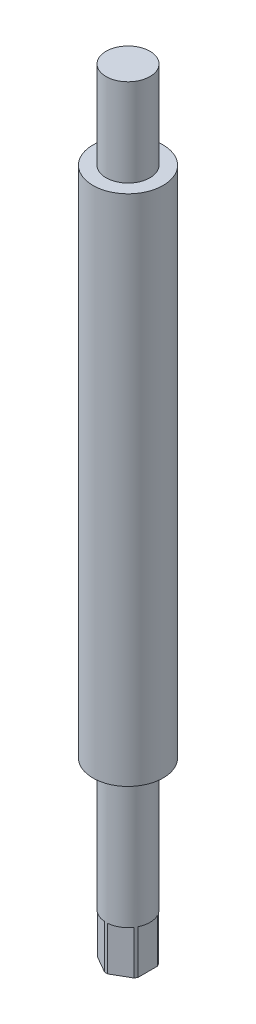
ISO-10303-21;
HEADER;
FILE_DESCRIPTION(('STEP AP214'),'2;1');
FILE_NAME('part.step','',(''),(''),'','','');
FILE_SCHEMA(('AUTOMOTIVE_DESIGN { 1 0 10303 214 1 1 1 1 }'));
ENDSEC;
DATA;
#1=APPLICATION_CONTEXT('core data for automotive mechanical design processes');
#2=APPLICATION_PROTOCOL_DEFINITION('international standard','automotive_design',2000,#1);
#3=PRODUCT_CONTEXT('',#1,'mechanical');
#4=PRODUCT('Part','Part','',(#3));
#5=PRODUCT_RELATED_PRODUCT_CATEGORY('part','',(#4));
#6=PRODUCT_DEFINITION_FORMATION('','',#4);
#7=PRODUCT_DEFINITION_CONTEXT('part definition',#1,'design');
#8=PRODUCT_DEFINITION('design','',#6,#7);
#9=PRODUCT_DEFINITION_SHAPE('','',#8);
#10=(LENGTH_UNIT() NAMED_UNIT(*) SI_UNIT(.MILLI.,.METRE.));
#11=(NAMED_UNIT(*) PLANE_ANGLE_UNIT() SI_UNIT($,.RADIAN.));
#12=(NAMED_UNIT(*) SI_UNIT($,.STERADIAN.) SOLID_ANGLE_UNIT());
#13=UNCERTAINTY_MEASURE_WITH_UNIT(LENGTH_MEASURE(1.E-05),#10,'distance_accuracy_value','');
#14=(GEOMETRIC_REPRESENTATION_CONTEXT(3) GLOBAL_UNCERTAINTY_ASSIGNED_CONTEXT((#13)) GLOBAL_UNIT_ASSIGNED_CONTEXT((#10,
#11,#12)) REPRESENTATION_CONTEXT('',''));
#15=CARTESIAN_POINT('',(0.,0.,0.));
#16=DIRECTION('',(0.,0.,1.));
#17=DIRECTION('',(1.,0.,0.));
#18=AXIS2_PLACEMENT_3D('',#15,#16,#17);
#19=CARTESIAN_POINT('',(0.,0.,0.));
#20=DIRECTION('',(0.,1.,0.));
#21=DIRECTION('',(0.,0.,1.00000000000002));
#22=AXIS2_PLACEMENT_3D('',#19,#20,#21);
#23=PLANE('',#22);
#24=DIRECTION('',(-0.866025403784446,0.,0.500000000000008));
#25=VECTOR('',#24,1.);
#26=CARTESIAN_POINT('',(4.49999999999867,-1.06858966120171E-12,2.59807621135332));
#27=LINE('',#26,#25);
#28=CARTESIAN_POINT('',(4.13745860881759,0.,2.80738958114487));
#29=VERTEX_POINT('',#28);
#30=CARTESIAN_POINT('',(0.362541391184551,-5.41233724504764E-13,4.98683905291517));
#31=VERTEX_POINT('',#30);
#32=EDGE_CURVE('E140',#29,#31,#27,.T.);
#33=ORIENTED_EDGE('',*,*,#32,.T.);
#34=CARTESIAN_POINT('',(0.,0.,0.));
#35=DIRECTION('',(0.,-1.,0.));
#36=DIRECTION('',(0.,0.,-1.00000000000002));
#37=AXIS2_PLACEMENT_3D('',#34,#35,#36);
#38=CIRCLE('',#37,4.99999999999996);
#39=CARTESIAN_POINT('',(-0.362541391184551,-6.52256026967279E-13,4.98683905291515));
#40=VERTEX_POINT('',#39);
#41=EDGE_CURVE('E139',#31,#40,#38,.T.);
#42=ORIENTED_EDGE('',*,*,#41,.T.);
#43=DIRECTION('',(-0.866025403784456,0.,-0.500000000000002));
#44=VECTOR('',#43,1.);
#45=CARTESIAN_POINT('',(0.,-1.06858966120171E-12,5.1961524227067));
#46=LINE('',#45,#44);
#47=CARTESIAN_POINT('',(-4.13745860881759,0.,2.8073895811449));
#48=VERTEX_POINT('',#47);
#49=EDGE_CURVE('E123',#40,#48,#46,.T.);
#50=ORIENTED_EDGE('',*,*,#49,.T.);
#51=CARTESIAN_POINT('',(-4.5,0.,2.17944947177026));
#52=VERTEX_POINT('',#51);
#53=EDGE_CURVE('E137',#48,#52,#38,.T.);
#54=ORIENTED_EDGE('',*,*,#53,.T.);
#55=DIRECTION('',(0.,0.,-1.00000000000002));
#56=VECTOR('',#55,1.);
#57=CARTESIAN_POINT('',(-4.49999999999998,0.,2.59807621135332));
#58=LINE('',#57,#56);
#59=CARTESIAN_POINT('',(-4.5,0.,-2.17944947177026));
#60=VERTEX_POINT('',#59);
#61=EDGE_CURVE('E55',#52,#60,#58,.T.);
#62=ORIENTED_EDGE('',*,*,#61,.T.);
#63=CARTESIAN_POINT('',(-4.13745860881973,2.22044604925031E-13,-2.80738958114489));
#64=VERTEX_POINT('',#63);
#65=EDGE_CURVE('E145',#60,#64,#38,.T.);
#66=ORIENTED_EDGE('',*,*,#65,.T.);
#67=DIRECTION('',(0.866025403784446,0.,-0.500000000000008));
#68=VECTOR('',#67,1.);
#69=CARTESIAN_POINT('',(-4.50000000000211,0.,-2.59807621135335));
#70=LINE('',#69,#68);
#71=CARTESIAN_POINT('',(-0.362541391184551,-2.22044604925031E-13,-4.98683905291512));
#72=VERTEX_POINT('',#71);
#73=EDGE_CURVE('E47',#64,#72,#70,.T.);
#74=ORIENTED_EDGE('',*,*,#73,.T.);
#75=CARTESIAN_POINT('',(0.362541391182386,0.,-4.98683905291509));
#76=VERTEX_POINT('',#75);
#77=EDGE_CURVE('E149',#72,#76,#38,.T.);
#78=ORIENTED_EDGE('',*,*,#77,.T.);
#79=DIRECTION('',(0.866025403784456,0.,0.500000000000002));
#80=VECTOR('',#79,1.);
#81=CARTESIAN_POINT('',(-2.13717932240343E-12,0.,-5.19615242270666));
#82=LINE('',#81,#80);
#83=CARTESIAN_POINT('',(4.13745860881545,-2.35922392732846E-13,-2.8073895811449));
#84=VERTEX_POINT('',#83);
#85=EDGE_CURVE('E208',#76,#84,#82,.T.);
#86=ORIENTED_EDGE('',*,*,#85,.T.);
#87=CARTESIAN_POINT('',(4.49999999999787,-8.74300631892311E-13,-2.17944947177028));
#88=VERTEX_POINT('',#87);
#89=EDGE_CURVE('E154',#84,#88,#38,.T.);
#90=ORIENTED_EDGE('',*,*,#89,.T.);
#91=DIRECTION('',(0.,0.,1.00000000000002));
#92=VECTOR('',#91,1.);
#93=CARTESIAN_POINT('',(4.49999999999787,-4.02455846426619E-13,-2.59807621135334));
#94=LINE('',#93,#92);
#95=CARTESIAN_POINT('',(4.49999999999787,-4.9960036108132E-13,2.17944947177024));
#96=VERTEX_POINT('',#95);
#97=EDGE_CURVE('E214',#88,#96,#94,.T.);
#98=ORIENTED_EDGE('',*,*,#97,.T.);
#99=EDGE_CURVE('E147',#96,#29,#38,.T.);
#100=ORIENTED_EDGE('',*,*,#99,.T.);
#101=EDGE_LOOP('',(#33,#42,#50,#54,#62,#66,#74,#78,#86,#90,#98,#100));
#102=FACE_BOUND('',#101,.T.);
#103=ADVANCED_FACE('F33',(#102),#23,.F.);
#104=CARTESIAN_POINT('',(0.,-17.5398947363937,0.));
#105=DIRECTION('',(0.,-1.,0.));
#106=DIRECTION('',(0.,0.,-1.00000000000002));
#107=AXIS2_PLACEMENT_3D('',#104,#105,#106);
#108=CYLINDRICAL_SURFACE('',#107,4.99999999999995);
#109=CARTESIAN_POINT('',(0.,40.,0.));
#110=DIRECTION('',(0.,-1.,0.));
#111=DIRECTION('',(0.,0.,-1.00000000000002));
#112=AXIS2_PLACEMENT_3D('',#109,#110,#111);
#113=CIRCLE('',#112,4.99999999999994);
#114=CARTESIAN_POINT('',(0.,40.,-5.00000000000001));
#115=VERTEX_POINT('',#114);
#116=EDGE_CURVE('E153',#115,#115,#113,.T.);
#117=ORIENTED_EDGE('',*,*,#116,.T.);
#118=EDGE_LOOP('',(#117));
#119=FACE_BOUND('',#118,.T.);
#120=DIRECTION('',(0.,-1.,0.));
#121=VECTOR('',#120,1.);
#122=CARTESIAN_POINT('',(0.362541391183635,-17.5398947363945,4.98683905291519));
#123=LINE('',#122,#121);
#124=CARTESIAN_POINT('',(0.362541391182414,9.99999999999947,4.98683905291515));
#125=VERTEX_POINT('',#124);
#126=EDGE_CURVE('E12',#125,#31,#123,.T.);
#127=ORIENTED_EDGE('',*,*,#126,.F.);
#128=CARTESIAN_POINT('',(-2.13717932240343E-12,9.99999999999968,0.));
#129=DIRECTION('',(0.,-1.,0.));
#130=DIRECTION('',(0.,0.,-1.00000000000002));
#131=AXIS2_PLACEMENT_3D('',#128,#129,#130);
#132=CIRCLE('',#131,4.99999999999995);
#133=CARTESIAN_POINT('',(4.13745860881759,9.99999999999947,2.80738958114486));
#134=VERTEX_POINT('',#133);
#135=EDGE_CURVE('E40',#134,#125,#132,.T.);
#136=ORIENTED_EDGE('',*,*,#135,.F.);
#137=DIRECTION('',(0.,-1.,0.));
#138=VECTOR('',#137,1.);
#139=CARTESIAN_POINT('',(4.13745860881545,-17.5398947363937,2.80738958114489));
#140=LINE('',#139,#138);
#141=EDGE_CURVE('E177',#29,#134,#140,.F.);
#142=ORIENTED_EDGE('',*,*,#141,.F.);
#143=ORIENTED_EDGE('',*,*,#99,.F.);
#144=DIRECTION('',(0.,-1.,0.));
#145=VECTOR('',#144,1.);
#146=CARTESIAN_POINT('',(4.49999999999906,-17.5398947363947,2.17944947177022));
#147=LINE('',#146,#145);
#148=CARTESIAN_POINT('',(4.49999999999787,9.9999999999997,2.17944947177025));
#149=VERTEX_POINT('',#148);
#150=EDGE_CURVE('E176',#149,#96,#147,.T.);
#151=ORIENTED_EDGE('',*,*,#150,.F.);
#152=CARTESIAN_POINT('',(4.49999999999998,9.99999999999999,-2.17944947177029));
#153=VERTEX_POINT('',#152);
#154=EDGE_CURVE('E175',#153,#149,#132,.T.);
#155=ORIENTED_EDGE('',*,*,#154,.F.);
#156=DIRECTION('',(0.,-1.,0.));
#157=VECTOR('',#156,1.);
#158=CARTESIAN_POINT('',(4.49999999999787,-17.5398947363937,-2.17944947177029));
#159=LINE('',#158,#157);
#160=EDGE_CURVE('E173',#88,#153,#159,.F.);
#161=ORIENTED_EDGE('',*,*,#160,.F.);
#162=ORIENTED_EDGE('',*,*,#89,.F.);
#163=DIRECTION('',(0.,-1.,0.));
#164=VECTOR('',#163,1.);
#165=CARTESIAN_POINT('',(4.13745860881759,-17.5398947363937,-2.80738958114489));
#166=LINE('',#165,#164);
#167=CARTESIAN_POINT('',(4.13745860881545,9.99999999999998,-2.8073895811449));
#168=VERTEX_POINT('',#167);
#169=EDGE_CURVE('E171',#168,#84,#166,.T.);
#170=ORIENTED_EDGE('',*,*,#169,.F.);
#171=CARTESIAN_POINT('',(0.362541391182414,9.99999999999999,-4.98683905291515));
#172=VERTEX_POINT('',#171);
#173=EDGE_CURVE('E170',#172,#168,#132,.T.);
#174=ORIENTED_EDGE('',*,*,#173,.F.);
#175=DIRECTION('',(0.,-1.,0.));
#176=VECTOR('',#175,1.);
#177=CARTESIAN_POINT('',(0.362541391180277,-17.5398947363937,-4.98683905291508));
#178=LINE('',#177,#176);
#179=EDGE_CURVE('E168',#76,#172,#178,.F.);
#180=ORIENTED_EDGE('',*,*,#179,.F.);
#181=ORIENTED_EDGE('',*,*,#77,.F.);
#182=DIRECTION('',(0.,-1.,0.));
#183=VECTOR('',#182,1.);
#184=CARTESIAN_POINT('',(-0.362541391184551,-17.5398947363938,-4.98683905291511));
#185=LINE('',#184,#183);
#186=CARTESIAN_POINT('',(-0.362541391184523,9.99999999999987,-4.98683905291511));
#187=VERTEX_POINT('',#186);
#188=EDGE_CURVE('E166',#187,#72,#185,.T.);
#189=ORIENTED_EDGE('',*,*,#188,.F.);
#190=CARTESIAN_POINT('',(-4.13745860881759,10.,-2.80738958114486));
#191=VERTEX_POINT('',#190);
#192=EDGE_CURVE('E165',#191,#187,#132,.T.);
#193=ORIENTED_EDGE('',*,*,#192,.F.);
#194=DIRECTION('',(0.,-1.,0.));
#195=VECTOR('',#194,1.);
#196=CARTESIAN_POINT('',(-4.13745860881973,-17.5398947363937,-2.80738958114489));
#197=LINE('',#196,#195);
#198=EDGE_CURVE('E163',#64,#191,#197,.F.);
#199=ORIENTED_EDGE('',*,*,#198,.F.);
#200=ORIENTED_EDGE('',*,*,#65,.F.);
#201=DIRECTION('',(0.,-1.,0.));
#202=VECTOR('',#201,1.);
#203=CARTESIAN_POINT('',(-4.5,-17.5398947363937,-2.17944947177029));
#204=LINE('',#203,#202);
#205=CARTESIAN_POINT('',(-4.49999999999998,9.99999999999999,-2.17944947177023));
#206=VERTEX_POINT('',#205);
#207=EDGE_CURVE('E161',#206,#60,#204,.T.);
#208=ORIENTED_EDGE('',*,*,#207,.F.);
#209=CARTESIAN_POINT('',(-4.5,9.99999999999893,2.17944947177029));
#210=VERTEX_POINT('',#209);
#211=EDGE_CURVE('E158',#210,#206,#132,.T.);
#212=ORIENTED_EDGE('',*,*,#211,.F.);
#213=DIRECTION('',(0.,-1.,0.));
#214=VECTOR('',#213,1.);
#215=CARTESIAN_POINT('',(-4.5,-17.5398947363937,2.17944947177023));
#216=LINE('',#215,#214);
#217=EDGE_CURVE('E130',#52,#210,#216,.F.);
#218=ORIENTED_EDGE('',*,*,#217,.F.);
#219=ORIENTED_EDGE('',*,*,#53,.F.);
#220=DIRECTION('',(0.,-1.,0.));
#221=VECTOR('',#220,1.);
#222=CARTESIAN_POINT('',(-4.13745860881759,-17.5398947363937,2.80738958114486));
#223=LINE('',#222,#221);
#224=CARTESIAN_POINT('',(-4.1374586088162,9.99999999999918,2.8073895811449));
#225=VERTEX_POINT('',#224);
#226=EDGE_CURVE('E120',#225,#48,#223,.T.);
#227=ORIENTED_EDGE('',*,*,#226,.F.);
#228=CARTESIAN_POINT('',(-0.362541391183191,9.99999999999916,4.98683905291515));
#229=VERTEX_POINT('',#228);
#230=EDGE_CURVE('E131',#229,#225,#132,.T.);
#231=ORIENTED_EDGE('',*,*,#230,.F.);
#232=DIRECTION('',(0.,-1.,0.));
#233=VECTOR('',#232,1.);
#234=CARTESIAN_POINT('',(-0.362541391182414,-17.5398947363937,4.98683905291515));
#235=LINE('',#234,#233);
#236=EDGE_CURVE('E156',#40,#229,#235,.F.);
#237=ORIENTED_EDGE('',*,*,#236,.F.);
#238=ORIENTED_EDGE('',*,*,#41,.F.);
#239=EDGE_LOOP('',(#127,#136,#142,#143,#151,#155,#161,#162,#170,#174,#180,#181,#189,#193,#199,
#200,#208,#212,#218,#219,#227,#231,#237,#238));
#240=FACE_BOUND('',#239,.T.);
#241=ADVANCED_FACE('F143',(#119,#240),#108,.T.);
#242=CARTESIAN_POINT('',(0.,40.,5.00000000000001));
#243=DIRECTION('',(0.,1.,0.));
#244=DIRECTION('',(0.,0.,1.00000000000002));
#245=AXIS2_PLACEMENT_3D('',#242,#243,#244);
#246=PLANE('',#245);
#247=ORIENTED_EDGE('',*,*,#116,.F.);
#248=EDGE_LOOP('',(#247));
#249=FACE_BOUND('',#248,.T.);
#250=CARTESIAN_POINT('',(0.,40.,0.));
#251=DIRECTION('',(0.,-1.,0.));
#252=DIRECTION('',(0.,0.,-1.00000000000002));
#253=AXIS2_PLACEMENT_3D('',#250,#251,#252);
#254=CIRCLE('',#253,7.99999999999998);
#255=CARTESIAN_POINT('',(0.,40.,-8.0000000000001));
#256=VERTEX_POINT('',#255);
#257=EDGE_CURVE('E233',#256,#256,#254,.T.);
#258=ORIENTED_EDGE('',*,*,#257,.T.);
#259=EDGE_LOOP('',(#258));
#260=FACE_BOUND('',#259,.T.);
#261=ADVANCED_FACE('F241',(#249,#260),#246,.F.);
#262=CARTESIAN_POINT('',(0.,-17.5398947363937,0.));
#263=DIRECTION('',(0.,-1.,0.));
#264=DIRECTION('',(0.,0.,-1.00000000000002));
#265=AXIS2_PLACEMENT_3D('',#262,#263,#264);
#266=CYLINDRICAL_SURFACE('',#265,7.99999999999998);
#267=ORIENTED_EDGE('',*,*,#257,.F.);
#268=EDGE_LOOP('',(#267));
#269=FACE_BOUND('',#268,.T.);
#270=CARTESIAN_POINT('',(-1.55431223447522E-12,156.999999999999,0.));
#271=DIRECTION('',(0.,-1.,0.));
#272=DIRECTION('',(0.,0.,-1.00000000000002));
#273=AXIS2_PLACEMENT_3D('',#270,#271,#272);
#274=CIRCLE('',#273,7.99999999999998);
#275=CARTESIAN_POINT('',(-1.55420815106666E-12,156.999999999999,-8.00000000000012));
#276=VERTEX_POINT('',#275);
#277=EDGE_CURVE('E231',#276,#276,#274,.T.);
#278=ORIENTED_EDGE('',*,*,#277,.T.);
#279=EDGE_LOOP('',(#278));
#280=FACE_BOUND('',#279,.T.);
#281=ADVANCED_FACE('F243',(#269,#280),#266,.T.);
#282=CARTESIAN_POINT('',(-1.02695629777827E-12,156.999999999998,8.00000000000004));
#283=DIRECTION('',(0.,-1.,0.));
#284=DIRECTION('',(0.,0.,-1.00000000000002));
#285=AXIS2_PLACEMENT_3D('',#282,#283,#284);
#286=PLANE('',#285);
#287=ORIENTED_EDGE('',*,*,#277,.F.);
#288=EDGE_LOOP('',(#287));
#289=FACE_BOUND('',#288,.T.);
#290=CARTESIAN_POINT('',(-1.55431223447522E-12,156.999999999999,0.));
#291=DIRECTION('',(0.,-1.,0.));
#292=DIRECTION('',(0.,0.,-1.00000000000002));
#293=AXIS2_PLACEMENT_3D('',#290,#291,#292);
#294=CIRCLE('',#293,4.99999999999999);
#295=CARTESIAN_POINT('',(-1.55424718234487E-12,156.999999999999,-5.00000000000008));
#296=VERTEX_POINT('',#295);
#297=EDGE_CURVE('E228',#296,#296,#294,.T.);
#298=ORIENTED_EDGE('',*,*,#297,.T.);
#299=EDGE_LOOP('',(#298));
#300=FACE_BOUND('',#299,.T.);
#301=ADVANCED_FACE('F248',(#289,#300),#286,.F.);
#302=CARTESIAN_POINT('',(0.,-17.5398947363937,0.));
#303=DIRECTION('',(0.,-1.,0.));
#304=DIRECTION('',(0.,0.,-1.00000000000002));
#305=AXIS2_PLACEMENT_3D('',#302,#303,#304);
#306=CYLINDRICAL_SURFACE('',#305,5.);
#307=ORIENTED_EDGE('',*,*,#297,.F.);
#308=EDGE_LOOP('',(#307));
#309=FACE_BOUND('',#308,.T.);
#310=CARTESIAN_POINT('',(-1.83186799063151E-12,176.999999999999,0.));
#311=DIRECTION('',(0.,-1.,0.));
#312=DIRECTION('',(0.,0.,-1.00000000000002));
#313=AXIS2_PLACEMENT_3D('',#310,#311,#312);
#314=CIRCLE('',#313,5.);
#315=CARTESIAN_POINT('',(-1.83180293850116E-12,176.999999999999,-5.00000000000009));
#316=VERTEX_POINT('',#315);
#317=EDGE_CURVE('E225',#316,#316,#314,.T.);
#318=ORIENTED_EDGE('',*,*,#317,.T.);
#319=EDGE_LOOP('',(#318));
#320=FACE_BOUND('',#319,.T.);
#321=ADVANCED_FACE('F317',(#309,#320),#306,.T.);
#322=CARTESIAN_POINT('',(-1.83186799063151E-12,176.999999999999,0.));
#323=DIRECTION('',(0.,-1.,0.));
#324=DIRECTION('',(0.,0.,-1.00000000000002));
#325=AXIS2_PLACEMENT_3D('',#322,#323,#324);
#326=PLANE('',#325);
#327=ORIENTED_EDGE('',*,*,#317,.F.);
#328=EDGE_LOOP('',(#327));
#329=FACE_BOUND('',#328,.T.);
#330=ADVANCED_FACE('F264',(#329),#326,.F.);
#331=CARTESIAN_POINT('',(0.,9.99999999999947,5.19615242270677));
#332=DIRECTION('',(-0.5,0.,0.866025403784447));
#333=DIRECTION('',(0.866025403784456,0.,0.500000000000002));
#334=AXIS2_PLACEMENT_3D('',#331,#332,#333);
#335=PLANE('',#334);
#336=ORIENTED_EDGE('',*,*,#226,.T.);
#337=ORIENTED_EDGE('',*,*,#49,.F.);
#338=ORIENTED_EDGE('',*,*,#236,.T.);
#339=DIRECTION('',(-0.866025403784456,0.,-0.500000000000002));
#340=VECTOR('',#339,1.);
#341=CARTESIAN_POINT('',(0.,9.99999999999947,5.19615242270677));
#342=LINE('',#341,#340);
#343=EDGE_CURVE('E126',#229,#225,#342,.T.);
#344=ORIENTED_EDGE('',*,*,#343,.T.);
#345=EDGE_LOOP('',(#336,#337,#338,#344));
#346=FACE_BOUND('',#345,.T.);
#347=ADVANCED_FACE('F122',(#346),#335,.T.);
#348=CARTESIAN_POINT('',(-2.13717932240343E-12,9.99999999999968,0.));
#349=DIRECTION('',(0.,-1.,0.));
#350=DIRECTION('',(0.,0.,-1.00000000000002));
#351=AXIS2_PLACEMENT_3D('',#348,#349,#350);
#352=PLANE('',#351);
#353=ORIENTED_EDGE('',*,*,#230,.T.);
#354=ORIENTED_EDGE('',*,*,#343,.F.);
#355=EDGE_LOOP('',(#353,#354));
#356=FACE_BOUND('',#355,.T.);
#357=ADVANCED_FACE('F263',(#356),#352,.T.);
#358=CARTESIAN_POINT('',(-4.49999999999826,9.99999999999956,2.59807621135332));
#359=DIRECTION('',(-1.00000000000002,0.,0.));
#360=DIRECTION('',(0.,0.,1.00000000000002));
#361=AXIS2_PLACEMENT_3D('',#358,#359,#360);
#362=PLANE('',#361);
#363=ORIENTED_EDGE('',*,*,#207,.T.);
#364=ORIENTED_EDGE('',*,*,#61,.F.);
#365=ORIENTED_EDGE('',*,*,#217,.T.);
#366=DIRECTION('',(0.,0.,-1.00000000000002));
#367=VECTOR('',#366,1.);
#368=CARTESIAN_POINT('',(-4.49999999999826,9.99999999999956,2.59807621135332));
#369=LINE('',#368,#367);
#370=EDGE_CURVE('E200',#210,#206,#369,.T.);
#371=ORIENTED_EDGE('',*,*,#370,.T.);
#372=EDGE_LOOP('',(#363,#364,#365,#371));
#373=FACE_BOUND('',#372,.T.);
#374=ADVANCED_FACE('F202',(#373),#362,.T.);
#375=ORIENTED_EDGE('',*,*,#211,.T.);
#376=ORIENTED_EDGE('',*,*,#370,.F.);
#377=EDGE_LOOP('',(#375,#376));
#378=FACE_BOUND('',#377,.T.);
#379=ADVANCED_FACE('F199',(#378),#352,.T.);
#380=CARTESIAN_POINT('',(-4.5,10.,-2.59807621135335));
#381=DIRECTION('',(-0.500000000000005,0.,-0.866025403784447));
#382=DIRECTION('',(-0.866025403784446,0.,0.500000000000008));
#383=AXIS2_PLACEMENT_3D('',#380,#381,#382);
#384=PLANE('',#383);
#385=ORIENTED_EDGE('',*,*,#188,.T.);
#386=ORIENTED_EDGE('',*,*,#73,.F.);
#387=ORIENTED_EDGE('',*,*,#198,.T.);
#388=DIRECTION('',(0.866025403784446,0.,-0.500000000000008));
#389=VECTOR('',#388,1.);
#390=CARTESIAN_POINT('',(-4.5,10.,-2.59807621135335));
#391=LINE('',#390,#389);
#392=EDGE_CURVE('E203',#191,#187,#391,.T.);
#393=ORIENTED_EDGE('',*,*,#392,.T.);
#394=EDGE_LOOP('',(#385,#386,#387,#393));
#395=FACE_BOUND('',#394,.T.);
#396=ADVANCED_FACE('F279',(#395),#384,.T.);
#397=ORIENTED_EDGE('',*,*,#192,.T.);
#398=ORIENTED_EDGE('',*,*,#392,.F.);
#399=EDGE_LOOP('',(#397,#398));
#400=FACE_BOUND('',#399,.T.);
#401=ADVANCED_FACE('F280',(#400),#352,.T.);
#402=CARTESIAN_POINT('',(-2.13717932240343E-12,9.99999999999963,-5.19615242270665));
#403=DIRECTION('',(0.5,0.,-0.866025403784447));
#404=DIRECTION('',(-0.866025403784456,0.,-0.500000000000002));
#405=AXIS2_PLACEMENT_3D('',#402,#403,#404);
#406=PLANE('',#405);
#407=ORIENTED_EDGE('',*,*,#169,.T.);
#408=ORIENTED_EDGE('',*,*,#85,.F.);
#409=ORIENTED_EDGE('',*,*,#179,.T.);
#410=DIRECTION('',(0.866025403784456,0.,0.500000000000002));
#411=VECTOR('',#410,1.);
#412=CARTESIAN_POINT('',(-2.13717932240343E-12,9.99999999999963,-5.19615242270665));
#413=LINE('',#412,#411);
#414=EDGE_CURVE('E221',#172,#168,#413,.T.);
#415=ORIENTED_EDGE('',*,*,#414,.T.);
#416=EDGE_LOOP('',(#407,#408,#409,#415));
#417=FACE_BOUND('',#416,.T.);
#418=ADVANCED_FACE('F288',(#417),#406,.T.);
#419=ORIENTED_EDGE('',*,*,#173,.T.);
#420=ORIENTED_EDGE('',*,*,#414,.F.);
#421=EDGE_LOOP('',(#419,#420));
#422=FACE_BOUND('',#421,.T.);
#423=ADVANCED_FACE('F289',(#422),#352,.T.);
#424=CARTESIAN_POINT('',(4.49999999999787,9.99999999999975,-2.59807621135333));
#425=DIRECTION('',(1.00000000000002,0.,0.));
#426=DIRECTION('',(0.,0.,-1.00000000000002));
#427=AXIS2_PLACEMENT_3D('',#424,#425,#426);
#428=PLANE('',#427);
#429=ORIENTED_EDGE('',*,*,#150,.T.);
#430=ORIENTED_EDGE('',*,*,#97,.F.);
#431=ORIENTED_EDGE('',*,*,#160,.T.);
#432=DIRECTION('',(0.,0.,1.00000000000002));
#433=VECTOR('',#432,1.);
#434=CARTESIAN_POINT('',(4.49999999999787,9.99999999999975,-2.59807621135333));
#435=LINE('',#434,#433);
#436=EDGE_CURVE('E223',#153,#149,#435,.T.);
#437=ORIENTED_EDGE('',*,*,#436,.T.);
#438=EDGE_LOOP('',(#429,#430,#431,#437));
#439=FACE_BOUND('',#438,.T.);
#440=ADVANCED_FACE('F298',(#439),#428,.T.);
#441=ORIENTED_EDGE('',*,*,#154,.T.);
#442=ORIENTED_EDGE('',*,*,#436,.F.);
#443=EDGE_LOOP('',(#441,#442));
#444=FACE_BOUND('',#443,.T.);
#445=ADVANCED_FACE('F299',(#444),#352,.T.);
#446=ORIENTED_EDGE('',*,*,#135,.T.);
#447=DIRECTION('',(-0.866025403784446,0.,0.500000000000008));
#448=VECTOR('',#447,1.);
#449=CARTESIAN_POINT('',(4.5,10.,2.59807621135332));
#450=LINE('',#449,#448);
#451=EDGE_CURVE('E217',#134,#125,#450,.T.);
#452=ORIENTED_EDGE('',*,*,#451,.F.);
#453=EDGE_LOOP('',(#446,#452));
#454=FACE_BOUND('',#453,.T.);
#455=ADVANCED_FACE('F271',(#454),#352,.T.);
#456=CARTESIAN_POINT('',(4.5,10.,2.59807621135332));
#457=DIRECTION('',(0.500000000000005,0.,0.866025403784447));
#458=DIRECTION('',(0.866025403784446,0.,-0.500000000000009));
#459=AXIS2_PLACEMENT_3D('',#456,#457,#458);
#460=PLANE('',#459);
#461=ORIENTED_EDGE('',*,*,#126,.T.);
#462=ORIENTED_EDGE('',*,*,#32,.F.);
#463=ORIENTED_EDGE('',*,*,#141,.T.);
#464=ORIENTED_EDGE('',*,*,#451,.T.);
#465=EDGE_LOOP('',(#461,#462,#463,#464));
#466=FACE_BOUND('',#465,.T.);
#467=ADVANCED_FACE('F311',(#466),#460,.T.);
#468=CLOSED_SHELL('',(#103,#241,#261,#281,#301,#321,#330,#347,#357,#374,#379,#396,#401,#418,
#423,#440,#445,#455,#467));
#469=MANIFOLD_SOLID_BREP('B2',#468);
#470=ADVANCED_BREP_SHAPE_REPRESENTATION('',(#18,#469),#14);
#471=SHAPE_DEFINITION_REPRESENTATION(#9,#470);
ENDSEC;
END-ISO-10303-21;
